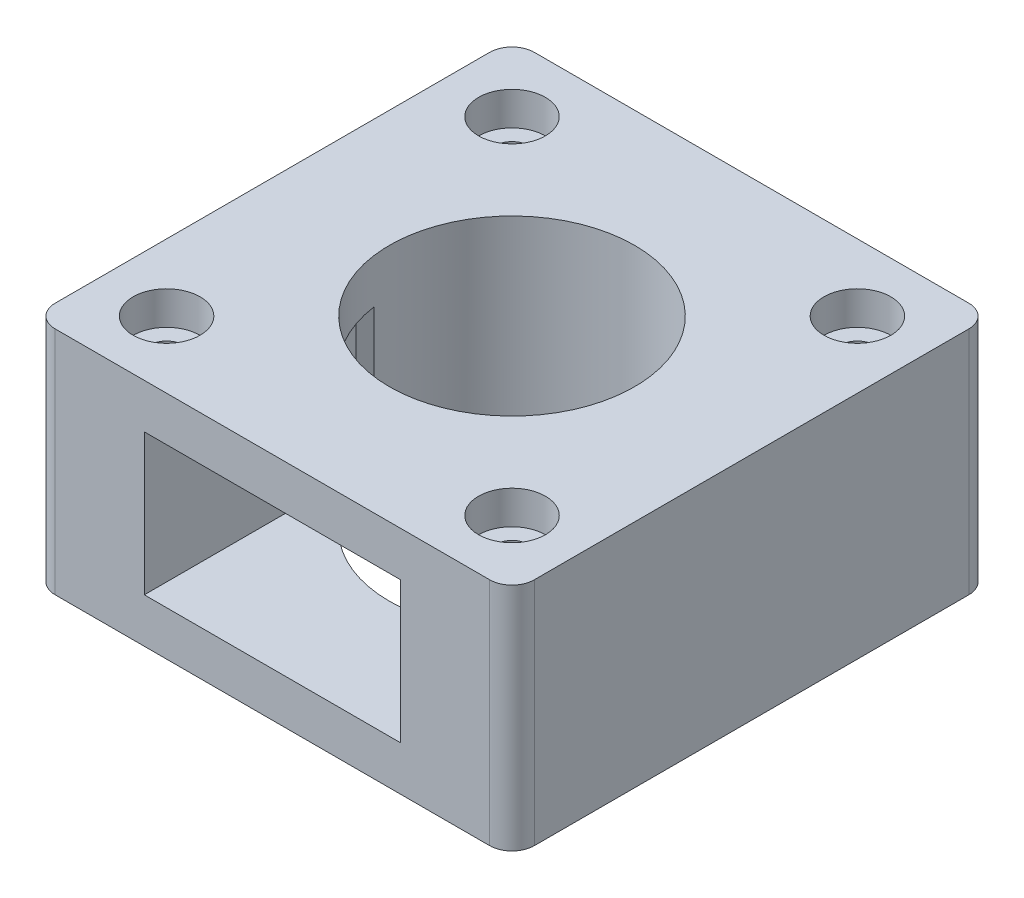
ISO-10303-21;
HEADER;
FILE_DESCRIPTION(('STEP AP214'),'2;1');
FILE_NAME('part.step','',(''),(''),'','','');
FILE_SCHEMA(('AUTOMOTIVE_DESIGN { 1 0 10303 214 1 1 1 1 }'));
ENDSEC;
DATA;
#1=APPLICATION_CONTEXT('core data for automotive mechanical design processes');
#2=APPLICATION_PROTOCOL_DEFINITION('international standard','automotive_design',2000,#1);
#3=PRODUCT_CONTEXT('',#1,'mechanical');
#4=PRODUCT('Part','Part','',(#3));
#5=PRODUCT_RELATED_PRODUCT_CATEGORY('part','',(#4));
#6=PRODUCT_DEFINITION_FORMATION('','',#4);
#7=PRODUCT_DEFINITION_CONTEXT('part definition',#1,'design');
#8=PRODUCT_DEFINITION('design','',#6,#7);
#9=PRODUCT_DEFINITION_SHAPE('','',#8);
#10=(LENGTH_UNIT() NAMED_UNIT(*) SI_UNIT(.MILLI.,.METRE.));
#11=(NAMED_UNIT(*) PLANE_ANGLE_UNIT() SI_UNIT($,.RADIAN.));
#12=(NAMED_UNIT(*) SI_UNIT($,.STERADIAN.) SOLID_ANGLE_UNIT());
#13=UNCERTAINTY_MEASURE_WITH_UNIT(LENGTH_MEASURE(1.E-05),#10,'distance_accuracy_value','');
#14=(GEOMETRIC_REPRESENTATION_CONTEXT(3) GLOBAL_UNCERTAINTY_ASSIGNED_CONTEXT((#13)) GLOBAL_UNIT_ASSIGNED_CONTEXT((#10,
#11,#12)) REPRESENTATION_CONTEXT('',''));
#15=CARTESIAN_POINT('',(0.,0.,0.));
#16=DIRECTION('',(0.,0.,1.));
#17=DIRECTION('',(1.,0.,0.));
#18=AXIS2_PLACEMENT_3D('',#15,#16,#17);
#19=CARTESIAN_POINT('',(-15.5,0.,-15.5));
#20=DIRECTION('',(0.,1.,0.));
#21=DIRECTION('',(0.,0.,1.));
#22=AXIS2_PLACEMENT_3D('',#19,#20,#21);
#23=CYLINDRICAL_SURFACE('',#22,1.5);
#24=CARTESIAN_POINT('',(-15.5,0.,-15.5));
#25=DIRECTION('',(0.,1.,0.));
#26=DIRECTION('',(0.,0.,1.));
#27=AXIS2_PLACEMENT_3D('',#24,#25,#26);
#28=CIRCLE('',#27,1.5);
#29=CARTESIAN_POINT('',(-15.5,0.,-14.));
#30=VERTEX_POINT('',#29);
#31=EDGE_CURVE('E203',#30,#30,#28,.T.);
#32=ORIENTED_EDGE('',*,*,#31,.F.);
#33=EDGE_LOOP('',(#32));
#34=FACE_BOUND('',#33,.T.);
#35=CARTESIAN_POINT('',(-15.5,17.67,-15.5));
#36=DIRECTION('',(0.,1.,0.));
#37=DIRECTION('',(0.,0.,1.));
#38=AXIS2_PLACEMENT_3D('',#35,#36,#37);
#39=CIRCLE('',#38,1.5);
#40=CARTESIAN_POINT('',(-15.5,17.67,-14.));
#41=VERTEX_POINT('',#40);
#42=EDGE_CURVE('E262',#41,#41,#39,.F.);
#43=ORIENTED_EDGE('',*,*,#42,.F.);
#44=EDGE_LOOP('',(#43));
#45=FACE_BOUND('',#44,.T.);
#46=ADVANCED_FACE('F45',(#34,#45),#23,.F.);
#47=CARTESIAN_POINT('',(15.5000000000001,0.,-15.4999999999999));
#48=DIRECTION('',(0.,1.,0.));
#49=DIRECTION('',(0.,0.,1.));
#50=AXIS2_PLACEMENT_3D('',#47,#48,#49);
#51=CYLINDRICAL_SURFACE('',#50,1.5);
#52=CARTESIAN_POINT('',(15.5000000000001,0.,-15.4999999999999));
#53=DIRECTION('',(0.,1.,0.));
#54=DIRECTION('',(0.,0.,1.));
#55=AXIS2_PLACEMENT_3D('',#52,#53,#54);
#56=CIRCLE('',#55,1.5);
#57=CARTESIAN_POINT('',(15.5000000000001,0.,-13.9999999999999));
#58=VERTEX_POINT('',#57);
#59=EDGE_CURVE('E200',#58,#58,#56,.T.);
#60=ORIENTED_EDGE('',*,*,#59,.F.);
#61=EDGE_LOOP('',(#60));
#62=FACE_BOUND('',#61,.T.);
#63=CARTESIAN_POINT('',(15.5000000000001,17.67,-15.4999999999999));
#64=DIRECTION('',(0.,1.,0.));
#65=DIRECTION('',(0.,0.,1.));
#66=AXIS2_PLACEMENT_3D('',#63,#64,#65);
#67=CIRCLE('',#66,1.5);
#68=CARTESIAN_POINT('',(15.5000000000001,17.67,-13.9999999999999));
#69=VERTEX_POINT('',#68);
#70=EDGE_CURVE('E259',#69,#69,#67,.F.);
#71=ORIENTED_EDGE('',*,*,#70,.F.);
#72=EDGE_LOOP('',(#71));
#73=FACE_BOUND('',#72,.T.);
#74=ADVANCED_FACE('F348',(#62,#73),#51,.F.);
#75=CARTESIAN_POINT('',(15.4999999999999,0.,15.5000000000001));
#76=DIRECTION('',(0.,1.,0.));
#77=DIRECTION('',(0.,0.,1.));
#78=AXIS2_PLACEMENT_3D('',#75,#76,#77);
#79=CYLINDRICAL_SURFACE('',#78,1.5);
#80=CARTESIAN_POINT('',(15.4999999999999,0.,15.5000000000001));
#81=DIRECTION('',(0.,1.,0.));
#82=DIRECTION('',(0.,0.,1.));
#83=AXIS2_PLACEMENT_3D('',#80,#81,#82);
#84=CIRCLE('',#83,1.5);
#85=CARTESIAN_POINT('',(15.4999999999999,0.,17.0000000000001));
#86=VERTEX_POINT('',#85);
#87=EDGE_CURVE('E204',#86,#86,#84,.T.);
#88=ORIENTED_EDGE('',*,*,#87,.F.);
#89=EDGE_LOOP('',(#88));
#90=FACE_BOUND('',#89,.T.);
#91=CARTESIAN_POINT('',(15.4999999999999,17.67,15.5000000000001));
#92=DIRECTION('',(0.,1.,0.));
#93=DIRECTION('',(0.,0.,1.));
#94=AXIS2_PLACEMENT_3D('',#91,#92,#93);
#95=CIRCLE('',#94,1.5);
#96=CARTESIAN_POINT('',(15.4999999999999,17.67,17.0000000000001));
#97=VERTEX_POINT('',#96);
#98=EDGE_CURVE('E255',#97,#97,#95,.F.);
#99=ORIENTED_EDGE('',*,*,#98,.F.);
#100=EDGE_LOOP('',(#99));
#101=FACE_BOUND('',#100,.T.);
#102=ADVANCED_FACE('F354',(#90,#101),#79,.F.);
#103=CARTESIAN_POINT('',(-15.5000000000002,0.,15.4999999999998));
#104=DIRECTION('',(0.,1.,0.));
#105=DIRECTION('',(0.,0.,1.));
#106=AXIS2_PLACEMENT_3D('',#103,#104,#105);
#107=CYLINDRICAL_SURFACE('',#106,1.5);
#108=CARTESIAN_POINT('',(-15.5000000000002,0.,15.4999999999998));
#109=DIRECTION('',(0.,1.,0.));
#110=DIRECTION('',(0.,0.,1.));
#111=AXIS2_PLACEMENT_3D('',#108,#109,#110);
#112=CIRCLE('',#111,1.5);
#113=CARTESIAN_POINT('',(-15.5000000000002,0.,16.9999999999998));
#114=VERTEX_POINT('',#113);
#115=EDGE_CURVE('E199',#114,#114,#112,.T.);
#116=ORIENTED_EDGE('',*,*,#115,.F.);
#117=EDGE_LOOP('',(#116));
#118=FACE_BOUND('',#117,.T.);
#119=CARTESIAN_POINT('',(-15.5000000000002,17.67,15.4999999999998));
#120=DIRECTION('',(0.,1.,0.));
#121=DIRECTION('',(0.,0.,1.));
#122=AXIS2_PLACEMENT_3D('',#119,#120,#121);
#123=CIRCLE('',#122,1.5);
#124=CARTESIAN_POINT('',(-15.5000000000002,17.67,16.9999999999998));
#125=VERTEX_POINT('',#124);
#126=EDGE_CURVE('E252',#125,#125,#123,.F.);
#127=ORIENTED_EDGE('',*,*,#126,.F.);
#128=EDGE_LOOP('',(#127));
#129=FACE_BOUND('',#128,.T.);
#130=ADVANCED_FACE('F361',(#118,#129),#107,.F.);
#131=CARTESIAN_POINT('',(0.,20.67,0.));
#132=DIRECTION('',(0.,-1.,0.));
#133=DIRECTION('',(0.,0.,-1.));
#134=AXIS2_PLACEMENT_3D('',#131,#132,#133);
#135=CYLINDRICAL_SURFACE('',#134,11.);
#136=DIRECTION('',(0.,-1.,0.));
#137=VECTOR('',#136,1.);
#138=CARTESIAN_POINT('',(10.8972473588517,20.67,1.5));
#139=LINE('',#138,#137);
#140=CARTESIAN_POINT('',(10.8972473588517,16.67,1.5));
#141=VERTEX_POINT('',#140);
#142=CARTESIAN_POINT('',(10.8972473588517,4.,1.5));
#143=VERTEX_POINT('',#142);
#144=EDGE_CURVE('E249',#141,#143,#139,.T.);
#145=ORIENTED_EDGE('',*,*,#144,.F.);
#146=CARTESIAN_POINT('',(0.,16.67,0.));
#147=DIRECTION('',(0.,1.,0.));
#148=DIRECTION('',(0.,0.,1.));
#149=AXIS2_PLACEMENT_3D('',#146,#147,#148);
#150=CIRCLE('',#149,11.);
#151=CARTESIAN_POINT('',(-10.8972473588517,16.67,1.5));
#152=VERTEX_POINT('',#151);
#153=EDGE_CURVE('E190',#152,#141,#150,.T.);
#154=ORIENTED_EDGE('',*,*,#153,.F.);
#155=DIRECTION('',(0.,-1.,0.));
#156=VECTOR('',#155,1.);
#157=CARTESIAN_POINT('',(-10.8972473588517,20.67,1.5));
#158=LINE('',#157,#156);
#159=CARTESIAN_POINT('',(-10.8972473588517,4.,1.5));
#160=VERTEX_POINT('',#159);
#161=EDGE_CURVE('E235',#160,#152,#158,.F.);
#162=ORIENTED_EDGE('',*,*,#161,.F.);
#163=CARTESIAN_POINT('',(0.,4.,0.));
#164=DIRECTION('',(0.,-1.,0.));
#165=DIRECTION('',(0.,0.,-1.));
#166=AXIS2_PLACEMENT_3D('',#163,#164,#165);
#167=CIRCLE('',#166,11.);
#168=EDGE_CURVE('E196',#143,#160,#167,.T.);
#169=ORIENTED_EDGE('',*,*,#168,.F.);
#170=EDGE_LOOP('',(#145,#154,#162,#169));
#171=FACE_BOUND('',#170,.T.);
#172=CARTESIAN_POINT('',(0.,20.67,0.));
#173=DIRECTION('',(0.,1.,0.));
#174=DIRECTION('',(0.,0.,1.));
#175=AXIS2_PLACEMENT_3D('',#172,#173,#174);
#176=CIRCLE('',#175,11.);
#177=CARTESIAN_POINT('',(0.,20.67,11.));
#178=VERTEX_POINT('',#177);
#179=EDGE_CURVE('E218',#178,#178,#176,.T.);
#180=ORIENTED_EDGE('',*,*,#179,.T.);
#181=EDGE_LOOP('',(#180));
#182=FACE_BOUND('',#181,.T.);
#183=CARTESIAN_POINT('',(0.,3.,0.));
#184=DIRECTION('',(0.,-1.,0.));
#185=DIRECTION('',(0.,0.,-1.));
#186=AXIS2_PLACEMENT_3D('',#183,#184,#185);
#187=CIRCLE('',#186,11.);
#188=CARTESIAN_POINT('',(0.,3.,-11.));
#189=VERTEX_POINT('',#188);
#190=EDGE_CURVE('E215',#189,#189,#187,.T.);
#191=ORIENTED_EDGE('',*,*,#190,.T.);
#192=EDGE_LOOP('',(#191));
#193=FACE_BOUND('',#192,.T.);
#194=ADVANCED_FACE('F340',(#171,#182,#193),#135,.F.);
#195=CARTESIAN_POINT('',(0.,20.67,0.));
#196=DIRECTION('',(0.,-1.,0.));
#197=DIRECTION('',(0.,0.,-1.));
#198=AXIS2_PLACEMENT_3D('',#195,#196,#197);
#199=PLANE('',#198);
#200=CARTESIAN_POINT('',(-15.5000000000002,20.67,15.4999999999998));
#201=DIRECTION('',(0.,1.,0.));
#202=DIRECTION('',(0.,0.,1.));
#203=AXIS2_PLACEMENT_3D('',#200,#201,#202);
#204=CIRCLE('',#203,3.);
#205=CARTESIAN_POINT('',(-15.5000000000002,20.67,18.4999999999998));
#206=VERTEX_POINT('',#205);
#207=EDGE_CURVE('E836',#206,#206,#204,.T.);
#208=ORIENTED_EDGE('',*,*,#207,.F.);
#209=EDGE_LOOP('',(#208));
#210=FACE_BOUND('',#209,.T.);
#211=CARTESIAN_POINT('',(15.4999999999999,20.67,15.5000000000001));
#212=DIRECTION('',(0.,1.,0.));
#213=DIRECTION('',(0.,0.,1.));
#214=AXIS2_PLACEMENT_3D('',#211,#212,#213);
#215=CIRCLE('',#214,3.);
#216=CARTESIAN_POINT('',(15.4999999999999,20.67,18.5000000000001));
#217=VERTEX_POINT('',#216);
#218=EDGE_CURVE('E854',#217,#217,#215,.T.);
#219=ORIENTED_EDGE('',*,*,#218,.F.);
#220=EDGE_LOOP('',(#219));
#221=FACE_BOUND('',#220,.T.);
#222=CARTESIAN_POINT('',(15.5000000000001,20.67,-15.4999999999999));
#223=DIRECTION('',(0.,1.,0.));
#224=DIRECTION('',(0.,0.,1.));
#225=AXIS2_PLACEMENT_3D('',#222,#223,#224);
#226=CIRCLE('',#225,3.);
#227=CARTESIAN_POINT('',(15.5000000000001,20.67,-12.4999999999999));
#228=VERTEX_POINT('',#227);
#229=EDGE_CURVE('E845',#228,#228,#226,.T.);
#230=ORIENTED_EDGE('',*,*,#229,.F.);
#231=EDGE_LOOP('',(#230));
#232=FACE_BOUND('',#231,.T.);
#233=CARTESIAN_POINT('',(-15.5,20.67,-15.5));
#234=DIRECTION('',(0.,1.,0.));
#235=DIRECTION('',(0.,0.,1.));
#236=AXIS2_PLACEMENT_3D('',#233,#234,#235);
#237=CIRCLE('',#236,3.);
#238=CARTESIAN_POINT('',(-15.5,20.67,-12.5));
#239=VERTEX_POINT('',#238);
#240=EDGE_CURVE('E324',#239,#239,#237,.T.);
#241=ORIENTED_EDGE('',*,*,#240,.F.);
#242=EDGE_LOOP('',(#241));
#243=FACE_BOUND('',#242,.T.);
#244=DIRECTION('',(0.,0.,1.));
#245=VECTOR('',#244,1.);
#246=CARTESIAN_POINT('',(-21.5,20.67,21.5));
#247=LINE('',#246,#245);
#248=CARTESIAN_POINT('',(-21.5,20.67,-19.5));
#249=VERTEX_POINT('',#248);
#250=CARTESIAN_POINT('',(-21.5,20.67,19.5));
#251=VERTEX_POINT('',#250);
#252=EDGE_CURVE('E229',#249,#251,#247,.T.);
#253=ORIENTED_EDGE('',*,*,#252,.T.);
#254=CARTESIAN_POINT('',(-19.5,20.67,19.5));
#255=DIRECTION('',(0.,-1.,0.));
#256=DIRECTION('',(0.,0.,-1.));
#257=AXIS2_PLACEMENT_3D('',#254,#255,#256);
#258=CIRCLE('',#257,2.);
#259=CARTESIAN_POINT('',(-19.5,20.67,21.5));
#260=VERTEX_POINT('',#259);
#261=EDGE_CURVE('E288',#251,#260,#258,.F.);
#262=ORIENTED_EDGE('',*,*,#261,.T.);
#263=DIRECTION('',(1.,0.,0.));
#264=VECTOR('',#263,1.);
#265=CARTESIAN_POINT('',(-21.5,20.67,21.5));
#266=LINE('',#265,#264);
#267=CARTESIAN_POINT('',(19.5,20.67,21.5));
#268=VERTEX_POINT('',#267);
#269=EDGE_CURVE('E232',#260,#268,#266,.T.);
#270=ORIENTED_EDGE('',*,*,#269,.T.);
#271=CARTESIAN_POINT('',(19.5,20.67,19.5));
#272=DIRECTION('',(0.,-1.,0.));
#273=DIRECTION('',(0.,0.,-1.));
#274=AXIS2_PLACEMENT_3D('',#271,#272,#273);
#275=CIRCLE('',#274,2.);
#276=CARTESIAN_POINT('',(21.5,20.67,19.5));
#277=VERTEX_POINT('',#276);
#278=EDGE_CURVE('E284',#268,#277,#275,.F.);
#279=ORIENTED_EDGE('',*,*,#278,.T.);
#280=DIRECTION('',(0.,0.,-1.));
#281=VECTOR('',#280,1.);
#282=CARTESIAN_POINT('',(21.5,20.67,21.5));
#283=LINE('',#282,#281);
#284=CARTESIAN_POINT('',(21.5,20.67,-19.5));
#285=VERTEX_POINT('',#284);
#286=EDGE_CURVE('E222',#277,#285,#283,.T.);
#287=ORIENTED_EDGE('',*,*,#286,.T.);
#288=CARTESIAN_POINT('',(19.5,20.67,-19.5));
#289=DIRECTION('',(0.,-1.,0.));
#290=DIRECTION('',(0.,0.,-1.));
#291=AXIS2_PLACEMENT_3D('',#288,#289,#290);
#292=CIRCLE('',#291,2.);
#293=CARTESIAN_POINT('',(19.5,20.67,-21.5));
#294=VERTEX_POINT('',#293);
#295=EDGE_CURVE('E282',#285,#294,#292,.F.);
#296=ORIENTED_EDGE('',*,*,#295,.T.);
#297=DIRECTION('',(-1.,0.,0.));
#298=VECTOR('',#297,1.);
#299=CARTESIAN_POINT('',(-21.5,20.67,-21.5));
#300=LINE('',#299,#298);
#301=CARTESIAN_POINT('',(-19.5,20.67,-21.5));
#302=VERTEX_POINT('',#301);
#303=EDGE_CURVE('E225',#294,#302,#300,.T.);
#304=ORIENTED_EDGE('',*,*,#303,.T.);
#305=CARTESIAN_POINT('',(-19.5,20.67,-19.5));
#306=DIRECTION('',(0.,-1.,0.));
#307=DIRECTION('',(0.,0.,-1.));
#308=AXIS2_PLACEMENT_3D('',#305,#306,#307);
#309=CIRCLE('',#308,2.);
#310=EDGE_CURVE('E286',#302,#249,#309,.F.);
#311=ORIENTED_EDGE('',*,*,#310,.T.);
#312=EDGE_LOOP('',(#253,#262,#270,#279,#287,#296,#304,#311));
#313=FACE_BOUND('',#312,.T.);
#314=ORIENTED_EDGE('',*,*,#179,.F.);
#315=EDGE_LOOP('',(#314));
#316=FACE_BOUND('',#315,.T.);
#317=ADVANCED_FACE('F373',(#210,#221,#232,#243,#313,#316),#199,.F.);
#318=CARTESIAN_POINT('',(0.,0.,0.));
#319=DIRECTION('',(0.,-1.,0.));
#320=DIRECTION('',(0.,0.,-1.));
#321=AXIS2_PLACEMENT_3D('',#318,#319,#320);
#322=PLANE('',#321);
#323=ORIENTED_EDGE('',*,*,#115,.T.);
#324=EDGE_LOOP('',(#323));
#325=FACE_BOUND('',#324,.T.);
#326=ORIENTED_EDGE('',*,*,#87,.T.);
#327=EDGE_LOOP('',(#326));
#328=FACE_BOUND('',#327,.T.);
#329=ORIENTED_EDGE('',*,*,#59,.T.);
#330=EDGE_LOOP('',(#329));
#331=FACE_BOUND('',#330,.T.);
#332=ORIENTED_EDGE('',*,*,#31,.T.);
#333=EDGE_LOOP('',(#332));
#334=FACE_BOUND('',#333,.T.);
#335=CARTESIAN_POINT('',(0.,0.,0.));
#336=DIRECTION('',(0.,-1.,0.));
#337=DIRECTION('',(0.,0.,-1.));
#338=AXIS2_PLACEMENT_3D('',#335,#336,#337);
#339=CIRCLE('',#338,12.5);
#340=CARTESIAN_POINT('',(0.,0.,-12.5));
#341=VERTEX_POINT('',#340);
#342=EDGE_CURVE('E211',#341,#341,#339,.T.);
#343=ORIENTED_EDGE('',*,*,#342,.F.);
#344=EDGE_LOOP('',(#343));
#345=FACE_BOUND('',#344,.T.);
#346=DIRECTION('',(1.,0.,0.));
#347=VECTOR('',#346,1.);
#348=CARTESIAN_POINT('',(-21.5,0.,21.5));
#349=LINE('',#348,#347);
#350=CARTESIAN_POINT('',(-19.5,0.,21.5));
#351=VERTEX_POINT('',#350);
#352=CARTESIAN_POINT('',(19.5,0.,21.5));
#353=VERTEX_POINT('',#352);
#354=EDGE_CURVE('E226',#351,#353,#349,.T.);
#355=ORIENTED_EDGE('',*,*,#354,.F.);
#356=CARTESIAN_POINT('',(-19.5,0.,19.5));
#357=DIRECTION('',(0.,-1.,0.));
#358=DIRECTION('',(0.,0.,-1.));
#359=AXIS2_PLACEMENT_3D('',#356,#357,#358);
#360=CIRCLE('',#359,2.);
#361=CARTESIAN_POINT('',(-21.5,0.,19.5));
#362=VERTEX_POINT('',#361);
#363=EDGE_CURVE('E275',#351,#362,#360,.T.);
#364=ORIENTED_EDGE('',*,*,#363,.T.);
#365=DIRECTION('',(0.,0.,1.));
#366=VECTOR('',#365,1.);
#367=CARTESIAN_POINT('',(-21.5,0.,21.5));
#368=LINE('',#367,#366);
#369=CARTESIAN_POINT('',(-21.5,0.,-19.5));
#370=VERTEX_POINT('',#369);
#371=EDGE_CURVE('E241',#370,#362,#368,.T.);
#372=ORIENTED_EDGE('',*,*,#371,.F.);
#373=CARTESIAN_POINT('',(-19.5,0.,-19.5));
#374=DIRECTION('',(0.,-1.,0.));
#375=DIRECTION('',(0.,0.,-1.));
#376=AXIS2_PLACEMENT_3D('',#373,#374,#375);
#377=CIRCLE('',#376,2.);
#378=CARTESIAN_POINT('',(-19.5,0.,-21.5));
#379=VERTEX_POINT('',#378);
#380=EDGE_CURVE('E273',#370,#379,#377,.T.);
#381=ORIENTED_EDGE('',*,*,#380,.T.);
#382=DIRECTION('',(-1.,0.,0.));
#383=VECTOR('',#382,1.);
#384=CARTESIAN_POINT('',(-21.5,0.,-21.5));
#385=LINE('',#384,#383);
#386=CARTESIAN_POINT('',(19.5,0.,-21.5));
#387=VERTEX_POINT('',#386);
#388=EDGE_CURVE('E238',#387,#379,#385,.T.);
#389=ORIENTED_EDGE('',*,*,#388,.F.);
#390=CARTESIAN_POINT('',(19.5,0.,-19.5));
#391=DIRECTION('',(0.,-1.,0.));
#392=DIRECTION('',(0.,0.,-1.));
#393=AXIS2_PLACEMENT_3D('',#390,#391,#392);
#394=CIRCLE('',#393,2.);
#395=CARTESIAN_POINT('',(21.5,0.,-19.5));
#396=VERTEX_POINT('',#395);
#397=EDGE_CURVE('E269',#387,#396,#394,.T.);
#398=ORIENTED_EDGE('',*,*,#397,.T.);
#399=DIRECTION('',(0.,0.,-1.));
#400=VECTOR('',#399,1.);
#401=CARTESIAN_POINT('',(21.5,0.,21.5));
#402=LINE('',#401,#400);
#403=CARTESIAN_POINT('',(21.5,0.,19.5));
#404=VERTEX_POINT('',#403);
#405=EDGE_CURVE('E221',#404,#396,#402,.T.);
#406=ORIENTED_EDGE('',*,*,#405,.F.);
#407=CARTESIAN_POINT('',(19.5,0.,19.5));
#408=DIRECTION('',(0.,-1.,0.));
#409=DIRECTION('',(0.,0.,-1.));
#410=AXIS2_PLACEMENT_3D('',#407,#408,#409);
#411=CIRCLE('',#410,2.);
#412=EDGE_CURVE('E271',#404,#353,#411,.T.);
#413=ORIENTED_EDGE('',*,*,#412,.T.);
#414=EDGE_LOOP('',(#355,#364,#372,#381,#389,#398,#406,#413));
#415=FACE_BOUND('',#414,.T.);
#416=ADVANCED_FACE('F376',(#325,#328,#331,#334,#345,#415),#322,.T.);
#417=CARTESIAN_POINT('',(21.5,20.67,21.5));
#418=DIRECTION('',(-1.,0.,0.));
#419=DIRECTION('',(0.,0.,1.));
#420=AXIS2_PLACEMENT_3D('',#417,#418,#419);
#421=PLANE('',#420);
#422=ORIENTED_EDGE('',*,*,#286,.F.);
#423=DIRECTION('',(0.,-1.,0.));
#424=VECTOR('',#423,1.);
#425=CARTESIAN_POINT('',(21.5,20.67,19.5));
#426=LINE('',#425,#424);
#427=EDGE_CURVE('E297',#277,#404,#426,.T.);
#428=ORIENTED_EDGE('',*,*,#427,.T.);
#429=ORIENTED_EDGE('',*,*,#405,.T.);
#430=DIRECTION('',(0.,-1.,0.));
#431=VECTOR('',#430,1.);
#432=CARTESIAN_POINT('',(21.5,20.67,-19.5));
#433=LINE('',#432,#431);
#434=EDGE_CURVE('E295',#396,#285,#433,.F.);
#435=ORIENTED_EDGE('',*,*,#434,.T.);
#436=EDGE_LOOP('',(#422,#428,#429,#435));
#437=FACE_BOUND('',#436,.T.);
#438=ADVANCED_FACE('F380',(#437),#421,.F.);
#439=CARTESIAN_POINT('',(-21.5,20.67,-21.5));
#440=DIRECTION('',(0.,0.,1.));
#441=DIRECTION('',(1.,0.,0.));
#442=AXIS2_PLACEMENT_3D('',#439,#440,#441);
#443=PLANE('',#442);
#444=ORIENTED_EDGE('',*,*,#388,.T.);
#445=DIRECTION('',(0.,-1.,0.));
#446=VECTOR('',#445,1.);
#447=CARTESIAN_POINT('',(-19.5,20.67,-21.5));
#448=LINE('',#447,#446);
#449=EDGE_CURVE('E293',#379,#302,#448,.F.);
#450=ORIENTED_EDGE('',*,*,#449,.T.);
#451=ORIENTED_EDGE('',*,*,#303,.F.);
#452=DIRECTION('',(0.,-1.,0.));
#453=VECTOR('',#452,1.);
#454=CARTESIAN_POINT('',(19.5,20.67,-21.5));
#455=LINE('',#454,#453);
#456=EDGE_CURVE('E290',#294,#387,#455,.T.);
#457=ORIENTED_EDGE('',*,*,#456,.T.);
#458=EDGE_LOOP('',(#444,#450,#451,#457));
#459=FACE_BOUND('',#458,.T.);
#460=ADVANCED_FACE('F387',(#459),#443,.F.);
#461=CARTESIAN_POINT('',(-21.5,20.67,21.5));
#462=DIRECTION('',(1.,0.,0.));
#463=DIRECTION('',(0.,0.,-1.));
#464=AXIS2_PLACEMENT_3D('',#461,#462,#463);
#465=PLANE('',#464);
#466=ORIENTED_EDGE('',*,*,#371,.T.);
#467=DIRECTION('',(0.,-1.,0.));
#468=VECTOR('',#467,1.);
#469=CARTESIAN_POINT('',(-21.5,20.67,19.5));
#470=LINE('',#469,#468);
#471=EDGE_CURVE('E280',#362,#251,#470,.F.);
#472=ORIENTED_EDGE('',*,*,#471,.T.);
#473=ORIENTED_EDGE('',*,*,#252,.F.);
#474=DIRECTION('',(0.,-1.,0.));
#475=VECTOR('',#474,1.);
#476=CARTESIAN_POINT('',(-21.5,20.67,-19.5));
#477=LINE('',#476,#475);
#478=EDGE_CURVE('E277',#249,#370,#477,.T.);
#479=ORIENTED_EDGE('',*,*,#478,.T.);
#480=EDGE_LOOP('',(#466,#472,#473,#479));
#481=FACE_BOUND('',#480,.T.);
#482=ADVANCED_FACE('F384',(#481),#465,.F.);
#483=CARTESIAN_POINT('',(-21.5,20.67,21.5));
#484=DIRECTION('',(0.,0.,-1.));
#485=DIRECTION('',(-1.,0.,0.));
#486=AXIS2_PLACEMENT_3D('',#483,#484,#485);
#487=PLANE('',#486);
#488=DIRECTION('',(-1.,0.,0.));
#489=VECTOR('',#488,1.);
#490=CARTESIAN_POINT('',(-11.5,16.67,21.5));
#491=LINE('',#490,#489);
#492=CARTESIAN_POINT('',(11.5,16.67,21.5));
#493=VERTEX_POINT('',#492);
#494=CARTESIAN_POINT('',(-11.5,16.67,21.5));
#495=VERTEX_POINT('',#494);
#496=EDGE_CURVE('E172',#493,#495,#491,.T.);
#497=ORIENTED_EDGE('',*,*,#496,.F.);
#498=DIRECTION('',(0.,1.,0.));
#499=VECTOR('',#498,1.);
#500=CARTESIAN_POINT('',(11.5,4.,21.5));
#501=LINE('',#500,#499);
#502=CARTESIAN_POINT('',(11.5,4.,21.5));
#503=VERTEX_POINT('',#502);
#504=EDGE_CURVE('E177',#503,#493,#501,.T.);
#505=ORIENTED_EDGE('',*,*,#504,.F.);
#506=DIRECTION('',(1.,0.,0.));
#507=VECTOR('',#506,1.);
#508=CARTESIAN_POINT('',(-11.5,4.,21.5));
#509=LINE('',#508,#507);
#510=CARTESIAN_POINT('',(-11.5,4.,21.5));
#511=VERTEX_POINT('',#510);
#512=EDGE_CURVE('E182',#511,#503,#509,.T.);
#513=ORIENTED_EDGE('',*,*,#512,.F.);
#514=DIRECTION('',(0.,-1.,0.));
#515=VECTOR('',#514,1.);
#516=CARTESIAN_POINT('',(-11.5,4.,21.5));
#517=LINE('',#516,#515);
#518=EDGE_CURVE('E163',#495,#511,#517,.T.);
#519=ORIENTED_EDGE('',*,*,#518,.F.);
#520=EDGE_LOOP('',(#497,#505,#513,#519));
#521=FACE_BOUND('',#520,.T.);
#522=ORIENTED_EDGE('',*,*,#269,.F.);
#523=DIRECTION('',(0.,-1.,0.));
#524=VECTOR('',#523,1.);
#525=CARTESIAN_POINT('',(-19.5,20.67,21.5));
#526=LINE('',#525,#524);
#527=EDGE_CURVE('E266',#260,#351,#526,.T.);
#528=ORIENTED_EDGE('',*,*,#527,.T.);
#529=ORIENTED_EDGE('',*,*,#354,.T.);
#530=DIRECTION('',(0.,-1.,0.));
#531=VECTOR('',#530,1.);
#532=CARTESIAN_POINT('',(19.5,20.67,21.5));
#533=LINE('',#532,#531);
#534=EDGE_CURVE('E251',#353,#268,#533,.F.);
#535=ORIENTED_EDGE('',*,*,#534,.T.);
#536=EDGE_LOOP('',(#522,#528,#529,#535));
#537=FACE_BOUND('',#536,.T.);
#538=ADVANCED_FACE('F179',(#521,#537),#487,.F.);
#539=CARTESIAN_POINT('',(0.,3.,0.));
#540=DIRECTION('',(0.,-1.,0.));
#541=DIRECTION('',(0.,0.,-1.));
#542=AXIS2_PLACEMENT_3D('',#539,#540,#541);
#543=CYLINDRICAL_SURFACE('',#542,12.5);
#544=CARTESIAN_POINT('',(0.,3.,0.));
#545=DIRECTION('',(0.,-1.,0.));
#546=DIRECTION('',(0.,0.,-1.));
#547=AXIS2_PLACEMENT_3D('',#544,#545,#546);
#548=CIRCLE('',#547,12.5);
#549=CARTESIAN_POINT('',(0.,3.,-12.5));
#550=VERTEX_POINT('',#549);
#551=EDGE_CURVE('E212',#550,#550,#548,.T.);
#552=ORIENTED_EDGE('',*,*,#551,.F.);
#553=EDGE_LOOP('',(#552));
#554=FACE_BOUND('',#553,.T.);
#555=ORIENTED_EDGE('',*,*,#342,.T.);
#556=EDGE_LOOP('',(#555));
#557=FACE_BOUND('',#556,.T.);
#558=ADVANCED_FACE('F366',(#554,#557),#543,.F.);
#559=CARTESIAN_POINT('',(0.,3.,0.));
#560=DIRECTION('',(0.,-1.,0.));
#561=DIRECTION('',(0.,0.,-1.));
#562=AXIS2_PLACEMENT_3D('',#559,#560,#561);
#563=PLANE('',#562);
#564=ORIENTED_EDGE('',*,*,#190,.F.);
#565=EDGE_LOOP('',(#564));
#566=FACE_BOUND('',#565,.T.);
#567=ORIENTED_EDGE('',*,*,#551,.T.);
#568=EDGE_LOOP('',(#567));
#569=FACE_BOUND('',#568,.T.);
#570=ADVANCED_FACE('F363',(#566,#569),#563,.T.);
#571=CARTESIAN_POINT('',(0.,0.,1.5));
#572=DIRECTION('',(0.,0.,-1.));
#573=DIRECTION('',(-1.,0.,0.));
#574=AXIS2_PLACEMENT_3D('',#571,#572,#573);
#575=PLANE('',#574);
#576=DIRECTION('',(1.,0.,0.));
#577=VECTOR('',#576,1.);
#578=CARTESIAN_POINT('',(-11.5,4.,1.5));
#579=LINE('',#578,#577);
#580=CARTESIAN_POINT('',(10.8991393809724,4.,1.5));
#581=VERTEX_POINT('',#580);
#582=EDGE_CURVE('E315',#143,#581,#579,.T.);
#583=ORIENTED_EDGE('',*,*,#582,.T.);
#584=DIRECTION('',(0.,1.,0.));
#585=VECTOR('',#584,1.);
#586=CARTESIAN_POINT('',(10.8991393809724,16.67,1.5));
#587=LINE('',#586,#585);
#588=CARTESIAN_POINT('',(10.8991393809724,16.67,1.5));
#589=VERTEX_POINT('',#588);
#590=EDGE_CURVE('E54',#581,#589,#587,.T.);
#591=ORIENTED_EDGE('',*,*,#590,.T.);
#592=DIRECTION('',(-1.,0.,0.));
#593=VECTOR('',#592,1.);
#594=CARTESIAN_POINT('',(-11.5,16.67,1.5));
#595=LINE('',#594,#593);
#596=EDGE_CURVE('E313',#589,#141,#595,.T.);
#597=ORIENTED_EDGE('',*,*,#596,.T.);
#598=ORIENTED_EDGE('',*,*,#144,.T.);
#599=EDGE_LOOP('',(#583,#591,#597,#598));
#600=FACE_BOUND('',#599,.T.);
#601=ADVANCED_FACE('F312',(#600),#575,.F.);
#602=CARTESIAN_POINT('',(11.5,4.,1.5));
#603=DIRECTION('',(1.,0.,0.));
#604=DIRECTION('',(0.,0.,-1.));
#605=AXIS2_PLACEMENT_3D('',#602,#603,#604);
#606=PLANE('',#605);
#607=DIRECTION('',(0.,0.,1.));
#608=VECTOR('',#607,1.);
#609=CARTESIAN_POINT('',(11.5,16.67,1.5));
#610=LINE('',#609,#608);
#611=CARTESIAN_POINT('',(11.5,16.67,2.50000000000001));
#612=VERTEX_POINT('',#611);
#613=EDGE_CURVE('E169',#612,#493,#610,.T.);
#614=ORIENTED_EDGE('',*,*,#613,.F.);
#615=DIRECTION('',(0.,-1.,0.));
#616=VECTOR('',#615,1.);
#617=CARTESIAN_POINT('',(11.5,4.,2.50000000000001));
#618=LINE('',#617,#616);
#619=CARTESIAN_POINT('',(11.5,4.,2.50000000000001));
#620=VERTEX_POINT('',#619);
#621=EDGE_CURVE('E11',#612,#620,#618,.T.);
#622=ORIENTED_EDGE('',*,*,#621,.T.);
#623=DIRECTION('',(0.,0.,1.));
#624=VECTOR('',#623,1.);
#625=CARTESIAN_POINT('',(11.5,4.,1.5));
#626=LINE('',#625,#624);
#627=EDGE_CURVE('E188',#620,#503,#626,.T.);
#628=ORIENTED_EDGE('',*,*,#627,.T.);
#629=ORIENTED_EDGE('',*,*,#504,.T.);
#630=EDGE_LOOP('',(#614,#622,#628,#629));
#631=FACE_BOUND('',#630,.T.);
#632=ADVANCED_FACE('F327',(#631),#606,.F.);
#633=CARTESIAN_POINT('',(-11.5,4.,1.5));
#634=DIRECTION('',(0.,-1.,0.));
#635=DIRECTION('',(0.,0.,-1.));
#636=AXIS2_PLACEMENT_3D('',#633,#634,#635);
#637=PLANE('',#636);
#638=CARTESIAN_POINT('',(-10.8991393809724,4.,1.5));
#639=VERTEX_POINT('',#638);
#640=EDGE_CURVE('E193',#639,#160,#579,.T.);
#641=ORIENTED_EDGE('',*,*,#640,.F.);
#642=DIRECTION('',(0.51503807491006,0.,-0.857167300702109));
#643=VECTOR('',#642,1.);
#644=CARTESIAN_POINT('',(-10.8991393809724,4.,1.5));
#645=LINE('',#644,#643);
#646=CARTESIAN_POINT('',(-11.5,4.,2.50000000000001));
#647=VERTEX_POINT('',#646);
#648=EDGE_CURVE('E305',#639,#647,#645,.F.);
#649=ORIENTED_EDGE('',*,*,#648,.T.);
#650=DIRECTION('',(0.,0.,1.));
#651=VECTOR('',#650,1.);
#652=CARTESIAN_POINT('',(-11.5,4.,1.5));
#653=LINE('',#652,#651);
#654=EDGE_CURVE('E168',#647,#511,#653,.T.);
#655=ORIENTED_EDGE('',*,*,#654,.T.);
#656=ORIENTED_EDGE('',*,*,#512,.T.);
#657=ORIENTED_EDGE('',*,*,#627,.F.);
#658=DIRECTION('',(0.51503807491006,0.,0.857167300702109));
#659=VECTOR('',#658,1.);
#660=CARTESIAN_POINT('',(10.8991393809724,4.,1.5));
#661=LINE('',#660,#659);
#662=EDGE_CURVE('E303',#620,#581,#661,.F.);
#663=ORIENTED_EDGE('',*,*,#662,.T.);
#664=ORIENTED_EDGE('',*,*,#582,.F.);
#665=ORIENTED_EDGE('',*,*,#168,.T.);
#666=EDGE_LOOP('',(#641,#649,#655,#656,#657,#663,#664,#665));
#667=FACE_BOUND('',#666,.T.);
#668=ADVANCED_FACE('F331',(#667),#637,.F.);
#669=CARTESIAN_POINT('',(-11.5,4.,1.5));
#670=DIRECTION('',(-1.,0.,0.));
#671=DIRECTION('',(0.,0.,1.));
#672=AXIS2_PLACEMENT_3D('',#669,#670,#671);
#673=PLANE('',#672);
#674=ORIENTED_EDGE('',*,*,#654,.F.);
#675=DIRECTION('',(0.,1.,0.));
#676=VECTOR('',#675,1.);
#677=CARTESIAN_POINT('',(-11.5,16.67,2.50000000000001));
#678=LINE('',#677,#676);
#679=CARTESIAN_POINT('',(-11.5,16.67,2.50000000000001));
#680=VERTEX_POINT('',#679);
#681=EDGE_CURVE('E166',#647,#680,#678,.T.);
#682=ORIENTED_EDGE('',*,*,#681,.T.);
#683=DIRECTION('',(0.,0.,1.));
#684=VECTOR('',#683,1.);
#685=CARTESIAN_POINT('',(-11.5,16.67,1.5));
#686=LINE('',#685,#684);
#687=EDGE_CURVE('E158',#680,#495,#686,.T.);
#688=ORIENTED_EDGE('',*,*,#687,.T.);
#689=ORIENTED_EDGE('',*,*,#518,.T.);
#690=EDGE_LOOP('',(#674,#682,#688,#689));
#691=FACE_BOUND('',#690,.T.);
#692=ADVANCED_FACE('F161',(#691),#673,.F.);
#693=CARTESIAN_POINT('',(-11.5,16.67,1.5));
#694=DIRECTION('',(0.,1.,0.));
#695=DIRECTION('',(0.,0.,1.));
#696=AXIS2_PLACEMENT_3D('',#693,#694,#695);
#697=PLANE('',#696);
#698=ORIENTED_EDGE('',*,*,#687,.F.);
#699=DIRECTION('',(-0.51503807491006,0.,0.857167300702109));
#700=VECTOR('',#699,1.);
#701=CARTESIAN_POINT('',(-10.8991393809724,16.67,1.5));
#702=LINE('',#701,#700);
#703=CARTESIAN_POINT('',(-10.8991393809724,16.67,1.5));
#704=VERTEX_POINT('',#703);
#705=EDGE_CURVE('E309',#680,#704,#702,.F.);
#706=ORIENTED_EDGE('',*,*,#705,.T.);
#707=EDGE_CURVE('E184',#152,#704,#595,.T.);
#708=ORIENTED_EDGE('',*,*,#707,.F.);
#709=ORIENTED_EDGE('',*,*,#153,.T.);
#710=ORIENTED_EDGE('',*,*,#596,.F.);
#711=DIRECTION('',(-0.51503807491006,0.,-0.857167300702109));
#712=VECTOR('',#711,1.);
#713=CARTESIAN_POINT('',(10.8991393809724,16.67,1.5));
#714=LINE('',#713,#712);
#715=EDGE_CURVE('E61',#589,#612,#714,.F.);
#716=ORIENTED_EDGE('',*,*,#715,.T.);
#717=ORIENTED_EDGE('',*,*,#613,.T.);
#718=ORIENTED_EDGE('',*,*,#496,.T.);
#719=EDGE_LOOP('',(#698,#706,#708,#709,#710,#716,#717,#718));
#720=FACE_BOUND('',#719,.T.);
#721=ADVANCED_FACE('F173',(#720),#697,.F.);
#722=ORIENTED_EDGE('',*,*,#707,.T.);
#723=DIRECTION('',(0.,-1.,0.));
#724=VECTOR('',#723,1.);
#725=CARTESIAN_POINT('',(-10.8991393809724,4.,1.5));
#726=LINE('',#725,#724);
#727=EDGE_CURVE('E300',#704,#639,#726,.T.);
#728=ORIENTED_EDGE('',*,*,#727,.T.);
#729=ORIENTED_EDGE('',*,*,#640,.T.);
#730=ORIENTED_EDGE('',*,*,#161,.T.);
#731=EDGE_LOOP('',(#722,#728,#729,#730));
#732=FACE_BOUND('',#731,.T.);
#733=ADVANCED_FACE('F336',(#732),#575,.F.);
#734=CARTESIAN_POINT('',(-15.5000000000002,17.67,15.4999999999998));
#735=DIRECTION('',(0.,1.,0.));
#736=DIRECTION('',(0.,0.,1.));
#737=AXIS2_PLACEMENT_3D('',#734,#735,#736);
#738=PLANE('',#737);
#739=CARTESIAN_POINT('',(-15.5000000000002,17.67,15.4999999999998));
#740=DIRECTION('',(0.,1.,0.));
#741=DIRECTION('',(0.,0.,1.));
#742=AXIS2_PLACEMENT_3D('',#739,#740,#741);
#743=CIRCLE('',#742,3.);
#744=CARTESIAN_POINT('',(-15.5000000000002,17.67,18.4999999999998));
#745=VERTEX_POINT('',#744);
#746=EDGE_CURVE('E835',#745,#745,#743,.T.);
#747=ORIENTED_EDGE('',*,*,#746,.T.);
#748=EDGE_LOOP('',(#747));
#749=FACE_BOUND('',#748,.T.);
#750=ORIENTED_EDGE('',*,*,#126,.T.);
#751=EDGE_LOOP('',(#750));
#752=FACE_BOUND('',#751,.T.);
#753=ADVANCED_FACE('F582',(#749,#752),#738,.T.);
#754=CARTESIAN_POINT('',(-15.5000000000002,17.67,15.4999999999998));
#755=DIRECTION('',(0.,1.,0.));
#756=DIRECTION('',(0.,0.,1.));
#757=AXIS2_PLACEMENT_3D('',#754,#755,#756);
#758=CYLINDRICAL_SURFACE('',#757,3.);
#759=ORIENTED_EDGE('',*,*,#746,.F.);
#760=EDGE_LOOP('',(#759));
#761=FACE_BOUND('',#760,.T.);
#762=ORIENTED_EDGE('',*,*,#207,.T.);
#763=EDGE_LOOP('',(#762));
#764=FACE_BOUND('',#763,.T.);
#765=ADVANCED_FACE('F570',(#761,#764),#758,.F.);
#766=CARTESIAN_POINT('',(15.4999999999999,17.67,15.5000000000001));
#767=DIRECTION('',(0.,1.,0.));
#768=DIRECTION('',(0.,0.,1.));
#769=AXIS2_PLACEMENT_3D('',#766,#767,#768);
#770=PLANE('',#769);
#771=CARTESIAN_POINT('',(15.4999999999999,17.67,15.5000000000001));
#772=DIRECTION('',(0.,1.,0.));
#773=DIRECTION('',(0.,0.,1.));
#774=AXIS2_PLACEMENT_3D('',#771,#772,#773);
#775=CIRCLE('',#774,3.);
#776=CARTESIAN_POINT('',(15.4999999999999,17.67,18.5000000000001));
#777=VERTEX_POINT('',#776);
#778=EDGE_CURVE('E839',#777,#777,#775,.T.);
#779=ORIENTED_EDGE('',*,*,#778,.T.);
#780=EDGE_LOOP('',(#779));
#781=FACE_BOUND('',#780,.T.);
#782=ORIENTED_EDGE('',*,*,#98,.T.);
#783=EDGE_LOOP('',(#782));
#784=FACE_BOUND('',#783,.T.);
#785=ADVANCED_FACE('F558',(#781,#784),#770,.T.);
#786=CARTESIAN_POINT('',(15.4999999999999,17.67,15.5000000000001));
#787=DIRECTION('',(0.,1.,0.));
#788=DIRECTION('',(0.,0.,1.));
#789=AXIS2_PLACEMENT_3D('',#786,#787,#788);
#790=CYLINDRICAL_SURFACE('',#789,3.);
#791=ORIENTED_EDGE('',*,*,#778,.F.);
#792=EDGE_LOOP('',(#791));
#793=FACE_BOUND('',#792,.T.);
#794=ORIENTED_EDGE('',*,*,#218,.T.);
#795=EDGE_LOOP('',(#794));
#796=FACE_BOUND('',#795,.T.);
#797=ADVANCED_FACE('F546',(#793,#796),#790,.F.);
#798=CARTESIAN_POINT('',(15.5000000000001,17.67,-15.4999999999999));
#799=DIRECTION('',(0.,1.,0.));
#800=DIRECTION('',(0.,0.,1.));
#801=AXIS2_PLACEMENT_3D('',#798,#799,#800);
#802=PLANE('',#801);
#803=CARTESIAN_POINT('',(15.5000000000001,17.67,-15.4999999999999));
#804=DIRECTION('',(0.,1.,0.));
#805=DIRECTION('',(0.,0.,1.));
#806=AXIS2_PLACEMENT_3D('',#803,#804,#805);
#807=CIRCLE('',#806,3.);
#808=CARTESIAN_POINT('',(15.5000000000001,17.67,-12.4999999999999));
#809=VERTEX_POINT('',#808);
#810=EDGE_CURVE('E849',#809,#809,#807,.T.);
#811=ORIENTED_EDGE('',*,*,#810,.T.);
#812=EDGE_LOOP('',(#811));
#813=FACE_BOUND('',#812,.T.);
#814=ORIENTED_EDGE('',*,*,#70,.T.);
#815=EDGE_LOOP('',(#814));
#816=FACE_BOUND('',#815,.T.);
#817=ADVANCED_FACE('F534',(#813,#816),#802,.T.);
#818=CARTESIAN_POINT('',(15.5000000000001,17.67,-15.4999999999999));
#819=DIRECTION('',(0.,1.,0.));
#820=DIRECTION('',(0.,0.,1.));
#821=AXIS2_PLACEMENT_3D('',#818,#819,#820);
#822=CYLINDRICAL_SURFACE('',#821,3.);
#823=ORIENTED_EDGE('',*,*,#810,.F.);
#824=EDGE_LOOP('',(#823));
#825=FACE_BOUND('',#824,.T.);
#826=ORIENTED_EDGE('',*,*,#229,.T.);
#827=EDGE_LOOP('',(#826));
#828=FACE_BOUND('',#827,.T.);
#829=ADVANCED_FACE('F522',(#825,#828),#822,.F.);
#830=CARTESIAN_POINT('',(-15.5,17.67,-15.5));
#831=DIRECTION('',(0.,1.,0.));
#832=DIRECTION('',(0.,0.,1.));
#833=AXIS2_PLACEMENT_3D('',#830,#831,#832);
#834=PLANE('',#833);
#835=CARTESIAN_POINT('',(-15.5,17.67,-15.5));
#836=DIRECTION('',(0.,1.,0.));
#837=DIRECTION('',(0.,0.,1.));
#838=AXIS2_PLACEMENT_3D('',#835,#836,#837);
#839=CIRCLE('',#838,3.);
#840=CARTESIAN_POINT('',(-15.5,17.67,-12.5));
#841=VERTEX_POINT('',#840);
#842=EDGE_CURVE('E256',#841,#841,#839,.T.);
#843=ORIENTED_EDGE('',*,*,#842,.T.);
#844=EDGE_LOOP('',(#843));
#845=FACE_BOUND('',#844,.T.);
#846=ORIENTED_EDGE('',*,*,#42,.T.);
#847=EDGE_LOOP('',(#846));
#848=FACE_BOUND('',#847,.T.);
#849=ADVANCED_FACE('F509',(#845,#848),#834,.T.);
#850=CARTESIAN_POINT('',(-15.5,17.67,-15.5));
#851=DIRECTION('',(0.,1.,0.));
#852=DIRECTION('',(0.,0.,1.));
#853=AXIS2_PLACEMENT_3D('',#850,#851,#852);
#854=CYLINDRICAL_SURFACE('',#853,3.);
#855=ORIENTED_EDGE('',*,*,#842,.F.);
#856=EDGE_LOOP('',(#855));
#857=FACE_BOUND('',#856,.T.);
#858=ORIENTED_EDGE('',*,*,#240,.T.);
#859=EDGE_LOOP('',(#858));
#860=FACE_BOUND('',#859,.T.);
#861=ADVANCED_FACE('F399',(#857,#860),#854,.F.);
#862=CARTESIAN_POINT('',(-19.5,20.67,19.5));
#863=DIRECTION('',(0.,-1.,0.));
#864=DIRECTION('',(0.,0.,-1.));
#865=AXIS2_PLACEMENT_3D('',#862,#863,#864);
#866=CYLINDRICAL_SURFACE('',#865,2.);
#867=ORIENTED_EDGE('',*,*,#261,.F.);
#868=ORIENTED_EDGE('',*,*,#471,.F.);
#869=ORIENTED_EDGE('',*,*,#363,.F.);
#870=ORIENTED_EDGE('',*,*,#527,.F.);
#871=EDGE_LOOP('',(#867,#868,#869,#870));
#872=FACE_BOUND('',#871,.T.);
#873=ADVANCED_FACE('F395',(#872),#866,.T.);
#874=CARTESIAN_POINT('',(-19.5,20.67,-19.5));
#875=DIRECTION('',(0.,-1.,0.));
#876=DIRECTION('',(0.,0.,-1.));
#877=AXIS2_PLACEMENT_3D('',#874,#875,#876);
#878=CYLINDRICAL_SURFACE('',#877,2.);
#879=ORIENTED_EDGE('',*,*,#310,.F.);
#880=ORIENTED_EDGE('',*,*,#449,.F.);
#881=ORIENTED_EDGE('',*,*,#380,.F.);
#882=ORIENTED_EDGE('',*,*,#478,.F.);
#883=EDGE_LOOP('',(#879,#880,#881,#882));
#884=FACE_BOUND('',#883,.T.);
#885=ADVANCED_FACE('F398',(#884),#878,.T.);
#886=CARTESIAN_POINT('',(19.5,20.67,19.5));
#887=DIRECTION('',(0.,-1.,0.));
#888=DIRECTION('',(0.,0.,-1.));
#889=AXIS2_PLACEMENT_3D('',#886,#887,#888);
#890=CYLINDRICAL_SURFACE('',#889,2.);
#891=ORIENTED_EDGE('',*,*,#278,.F.);
#892=ORIENTED_EDGE('',*,*,#534,.F.);
#893=ORIENTED_EDGE('',*,*,#412,.F.);
#894=ORIENTED_EDGE('',*,*,#427,.F.);
#895=EDGE_LOOP('',(#891,#892,#893,#894));
#896=FACE_BOUND('',#895,.T.);
#897=ADVANCED_FACE('F403',(#896),#890,.T.);
#898=CARTESIAN_POINT('',(19.5,20.67,-19.5));
#899=DIRECTION('',(0.,-1.,0.));
#900=DIRECTION('',(0.,0.,-1.));
#901=AXIS2_PLACEMENT_3D('',#898,#899,#900);
#902=CYLINDRICAL_SURFACE('',#901,2.);
#903=ORIENTED_EDGE('',*,*,#295,.F.);
#904=ORIENTED_EDGE('',*,*,#434,.F.);
#905=ORIENTED_EDGE('',*,*,#397,.F.);
#906=ORIENTED_EDGE('',*,*,#456,.F.);
#907=EDGE_LOOP('',(#903,#904,#905,#906));
#908=FACE_BOUND('',#907,.T.);
#909=ADVANCED_FACE('F346',(#908),#902,.T.);
#910=CARTESIAN_POINT('',(-10.8991393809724,0.,1.5));
#911=DIRECTION('',(0.857167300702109,0.,0.51503807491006));
#912=DIRECTION('',(0.,1.,0.));
#913=AXIS2_PLACEMENT_3D('',#910,#911,#912);
#914=PLANE('',#913);
#915=ORIENTED_EDGE('',*,*,#705,.F.);
#916=ORIENTED_EDGE('',*,*,#681,.F.);
#917=ORIENTED_EDGE('',*,*,#648,.F.);
#918=ORIENTED_EDGE('',*,*,#727,.F.);
#919=EDGE_LOOP('',(#915,#916,#917,#918));
#920=FACE_BOUND('',#919,.T.);
#921=ADVANCED_FACE('F333',(#920),#914,.T.);
#922=CARTESIAN_POINT('',(10.8991393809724,0.,1.5));
#923=DIRECTION('',(-0.857167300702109,0.,0.51503807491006));
#924=DIRECTION('',(0.,-1.,0.));
#925=AXIS2_PLACEMENT_3D('',#922,#923,#924);
#926=PLANE('',#925);
#927=ORIENTED_EDGE('',*,*,#662,.F.);
#928=ORIENTED_EDGE('',*,*,#621,.F.);
#929=ORIENTED_EDGE('',*,*,#715,.F.);
#930=ORIENTED_EDGE('',*,*,#590,.F.);
#931=EDGE_LOOP('',(#927,#928,#929,#930));
#932=FACE_BOUND('',#931,.T.);
#933=ADVANCED_FACE('F48',(#932),#926,.T.);
#934=CLOSED_SHELL('',(#46,#74,#102,#130,#194,#317,#416,#438,#460,#482,#538,#558,#570,#601,#632,
#668,#692,#721,#733,#753,#765,#785,#797,#817,#829,#849,#861,#873,#885,#897,#909,#921,#933));
#935=MANIFOLD_SOLID_BREP('B2',#934);
#936=ADVANCED_BREP_SHAPE_REPRESENTATION('',(#18,#935),#14);
#937=SHAPE_DEFINITION_REPRESENTATION(#9,#936);
ENDSEC;
END-ISO-10303-21;
